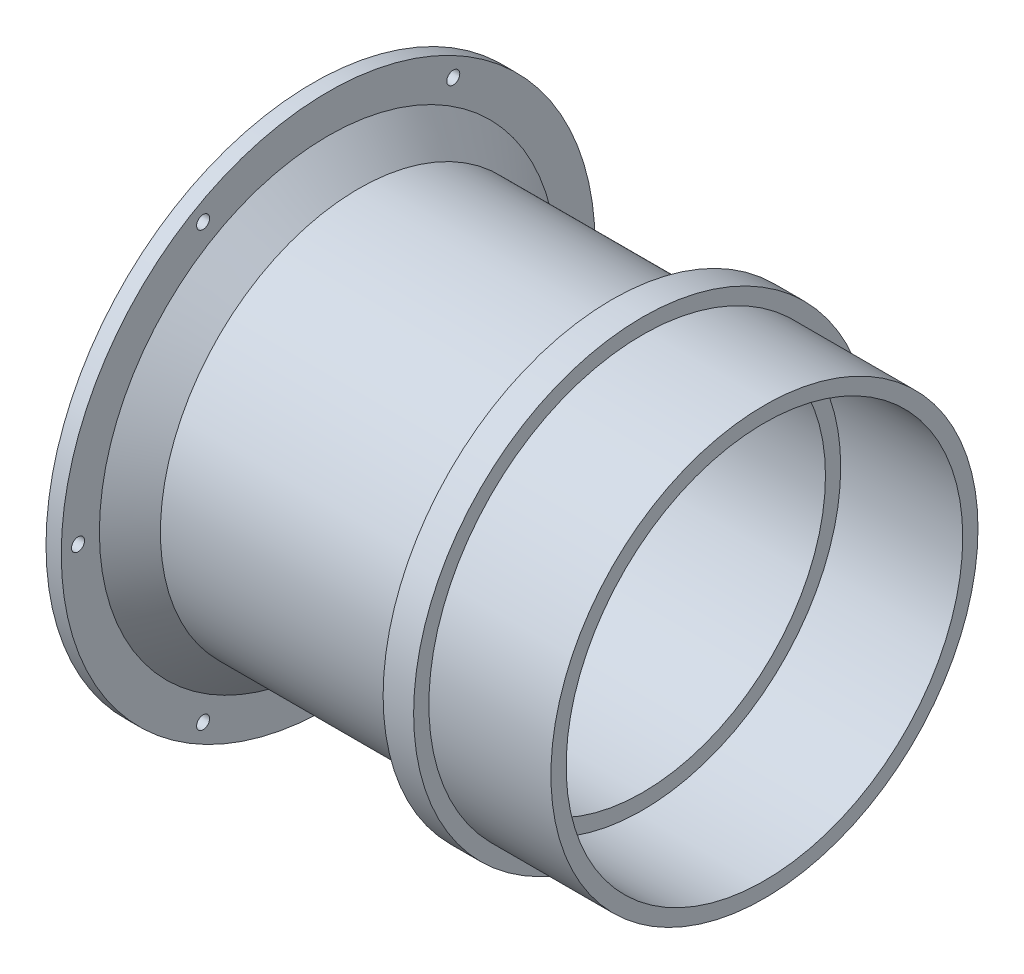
ISO-10303-21;
HEADER;
FILE_DESCRIPTION(('STEP AP214'),'2;1');
FILE_NAME('part.step','',(''),(''),'','','');
FILE_SCHEMA(('AUTOMOTIVE_DESIGN { 1 0 10303 214 1 1 1 1 }'));
ENDSEC;
DATA;
#1=APPLICATION_CONTEXT('core data for automotive mechanical design processes');
#2=APPLICATION_PROTOCOL_DEFINITION('international standard','automotive_design',2000,#1);
#3=PRODUCT_CONTEXT('',#1,'mechanical');
#4=PRODUCT('Part','Part','',(#3));
#5=PRODUCT_RELATED_PRODUCT_CATEGORY('part','',(#4));
#6=PRODUCT_DEFINITION_FORMATION('','',#4);
#7=PRODUCT_DEFINITION_CONTEXT('part definition',#1,'design');
#8=PRODUCT_DEFINITION('design','',#6,#7);
#9=PRODUCT_DEFINITION_SHAPE('','',#8);
#10=(LENGTH_UNIT() NAMED_UNIT(*) SI_UNIT(.MILLI.,.METRE.));
#11=(NAMED_UNIT(*) PLANE_ANGLE_UNIT() SI_UNIT($,.RADIAN.));
#12=(NAMED_UNIT(*) SI_UNIT($,.STERADIAN.) SOLID_ANGLE_UNIT());
#13=UNCERTAINTY_MEASURE_WITH_UNIT(LENGTH_MEASURE(1.E-05),#10,'distance_accuracy_value','');
#14=(GEOMETRIC_REPRESENTATION_CONTEXT(3) GLOBAL_UNCERTAINTY_ASSIGNED_CONTEXT((#13)) GLOBAL_UNIT_ASSIGNED_CONTEXT((#10,
#11,#12)) REPRESENTATION_CONTEXT('',''));
#15=CARTESIAN_POINT('',(0.,0.,0.));
#16=DIRECTION('',(0.,0.,1.));
#17=DIRECTION('',(1.,0.,0.));
#18=AXIS2_PLACEMENT_3D('',#15,#16,#17);
#19=CARTESIAN_POINT('',(0.,0.,0.));
#20=DIRECTION('',(1.,0.,0.));
#21=DIRECTION('',(0.,0.,-1.));
#22=AXIS2_PLACEMENT_3D('',#19,#20,#21);
#23=CYLINDRICAL_SURFACE('',#22,44.45);
#24=CARTESIAN_POINT('',(6.35,0.,0.));
#25=DIRECTION('',(1.,0.,0.));
#26=DIRECTION('',(0.,0.,-1.));
#27=AXIS2_PLACEMENT_3D('',#24,#25,#26);
#28=CIRCLE('',#27,44.45);
#29=CARTESIAN_POINT('',(6.35,0.,-44.45));
#30=VERTEX_POINT('',#29);
#31=EDGE_CURVE('E114',#30,#30,#28,.T.);
#32=ORIENTED_EDGE('',*,*,#31,.T.);
#33=EDGE_LOOP('',(#32));
#34=FACE_BOUND('',#33,.T.);
#35=CARTESIAN_POINT('',(0.,0.,0.));
#36=DIRECTION('',(1.,0.,0.));
#37=DIRECTION('',(0.,0.,-1.));
#38=AXIS2_PLACEMENT_3D('',#35,#36,#37);
#39=CIRCLE('',#38,44.45);
#40=CARTESIAN_POINT('',(0.,0.,-44.45));
#41=VERTEX_POINT('',#40);
#42=EDGE_CURVE('E44',#41,#41,#39,.T.);
#43=ORIENTED_EDGE('',*,*,#42,.F.);
#44=EDGE_LOOP('',(#43));
#45=FACE_BOUND('',#44,.T.);
#46=ADVANCED_FACE('F33',(#34,#45),#23,.F.);
#47=CARTESIAN_POINT('',(0.,48.26,0.));
#48=DIRECTION('',(-1.,0.,0.));
#49=DIRECTION('',(0.,0.,1.));
#50=AXIS2_PLACEMENT_3D('',#47,#48,#49);
#51=PLANE('',#50);
#52=CARTESIAN_POINT('',(0.,0.,0.));
#53=DIRECTION('',(-1.,0.,0.));
#54=DIRECTION('',(0.,0.,1.));
#55=AXIS2_PLACEMENT_3D('',#52,#53,#54);
#56=CIRCLE('',#55,47.752);
#57=CARTESIAN_POINT('',(0.,0.,47.752));
#58=VERTEX_POINT('',#57);
#59=EDGE_CURVE('E10',#58,#58,#56,.T.);
#60=ORIENTED_EDGE('',*,*,#59,.T.);
#61=EDGE_LOOP('',(#60));
#62=FACE_BOUND('',#61,.T.);
#63=ORIENTED_EDGE('',*,*,#42,.T.);
#64=EDGE_LOOP('',(#63));
#65=FACE_BOUND('',#64,.T.);
#66=ADVANCED_FACE('F262',(#62,#65),#51,.T.);
#67=CARTESIAN_POINT('',(0.,0.,0.));
#68=DIRECTION('',(1.,0.,0.));
#69=DIRECTION('',(0.,0.,-1.));
#70=AXIS2_PLACEMENT_3D('',#67,#68,#69);
#71=CYLINDRICAL_SURFACE('',#70,48.26);
#72=CARTESIAN_POINT('',(0.508000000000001,0.,0.));
#73=DIRECTION('',(-1.,0.,0.));
#74=DIRECTION('',(0.,0.,1.));
#75=AXIS2_PLACEMENT_3D('',#72,#73,#74);
#76=CIRCLE('',#75,48.26);
#77=CARTESIAN_POINT('',(0.508000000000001,0.,48.26));
#78=VERTEX_POINT('',#77);
#79=EDGE_CURVE('E40',#78,#78,#76,.F.);
#80=ORIENTED_EDGE('',*,*,#79,.T.);
#81=EDGE_LOOP('',(#80));
#82=FACE_BOUND('',#81,.T.);
#83=CARTESIAN_POINT('',(4.7752,0.,0.));
#84=DIRECTION('',(1.,0.,0.));
#85=DIRECTION('',(0.,0.,-1.));
#86=AXIS2_PLACEMENT_3D('',#83,#84,#85);
#87=CIRCLE('',#86,48.26);
#88=CARTESIAN_POINT('',(4.7752,0.,-48.26));
#89=VERTEX_POINT('',#88);
#90=EDGE_CURVE('E48',#89,#89,#87,.T.);
#91=ORIENTED_EDGE('',*,*,#90,.F.);
#92=EDGE_LOOP('',(#91));
#93=FACE_BOUND('',#92,.T.);
#94=ADVANCED_FACE('F147',(#82,#93),#71,.T.);
#95=CARTESIAN_POINT('',(4.7752,48.26,0.));
#96=DIRECTION('',(-1.,0.,0.));
#97=DIRECTION('',(0.,0.,1.));
#98=AXIS2_PLACEMENT_3D('',#95,#96,#97);
#99=PLANE('',#98);
#100=CARTESIAN_POINT('',(4.7752,-45.0939427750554,-26.0350000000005));
#101=DIRECTION('',(-1.,0.,0.));
#102=DIRECTION('',(0.,0.,1.));
#103=AXIS2_PLACEMENT_3D('',#100,#101,#102);
#104=CIRCLE('',#103,1.35255);
#105=CARTESIAN_POINT('',(4.7752,-45.0939427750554,-24.6824500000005));
#106=VERTEX_POINT('',#105);
#107=EDGE_CURVE('E137',#106,#106,#104,.T.);
#108=ORIENTED_EDGE('',*,*,#107,.F.);
#109=EDGE_LOOP('',(#108));
#110=FACE_BOUND('',#109,.T.);
#111=CARTESIAN_POINT('',(4.7752,-45.093942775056,26.0349999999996));
#112=DIRECTION('',(-1.,0.,0.));
#113=DIRECTION('',(0.,0.,1.));
#114=AXIS2_PLACEMENT_3D('',#111,#112,#113);
#115=CIRCLE('',#114,1.35255);
#116=CARTESIAN_POINT('',(4.7752,-45.093942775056,27.3875499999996));
#117=VERTEX_POINT('',#116);
#118=EDGE_CURVE('E131',#117,#117,#115,.T.);
#119=ORIENTED_EDGE('',*,*,#118,.F.);
#120=EDGE_LOOP('',(#119));
#121=FACE_BOUND('',#120,.T.);
#122=CARTESIAN_POINT('',(4.7752,0.,52.07));
#123=DIRECTION('',(-1.,0.,0.));
#124=DIRECTION('',(0.,0.,1.));
#125=AXIS2_PLACEMENT_3D('',#122,#123,#124);
#126=CIRCLE('',#125,1.35255);
#127=CARTESIAN_POINT('',(4.7752,0.,53.42255));
#128=VERTEX_POINT('',#127);
#129=EDGE_CURVE('E55',#128,#128,#126,.T.);
#130=ORIENTED_EDGE('',*,*,#129,.F.);
#131=EDGE_LOOP('',(#130));
#132=FACE_BOUND('',#131,.T.);
#133=CARTESIAN_POINT('',(4.7752,45.0939427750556,26.0350000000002));
#134=DIRECTION('',(-1.,0.,0.));
#135=DIRECTION('',(0.,0.,1.));
#136=AXIS2_PLACEMENT_3D('',#133,#134,#135);
#137=CIRCLE('',#136,1.35255);
#138=CARTESIAN_POINT('',(4.7752,45.0939427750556,27.3875500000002));
#139=VERTEX_POINT('',#138);
#140=EDGE_CURVE('E54',#139,#139,#137,.T.);
#141=ORIENTED_EDGE('',*,*,#140,.F.);
#142=EDGE_LOOP('',(#141));
#143=FACE_BOUND('',#142,.T.);
#144=CARTESIAN_POINT('',(4.7752,45.0939427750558,-26.0349999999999));
#145=DIRECTION('',(-1.,0.,0.));
#146=DIRECTION('',(0.,0.,1.));
#147=AXIS2_PLACEMENT_3D('',#144,#145,#146);
#148=CIRCLE('',#147,1.35255);
#149=CARTESIAN_POINT('',(4.7752,45.0939427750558,-24.6824499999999));
#150=VERTEX_POINT('',#149);
#151=EDGE_CURVE('E59',#150,#150,#148,.T.);
#152=ORIENTED_EDGE('',*,*,#151,.F.);
#153=EDGE_LOOP('',(#152));
#154=FACE_BOUND('',#153,.T.);
#155=CARTESIAN_POINT('',(4.7752,0.,-52.07));
#156=DIRECTION('',(-1.,0.,0.));
#157=DIRECTION('',(0.,0.,1.));
#158=AXIS2_PLACEMENT_3D('',#155,#156,#157);
#159=CIRCLE('',#158,1.35255);
#160=CARTESIAN_POINT('',(4.7752,0.,-50.71745));
#161=VERTEX_POINT('',#160);
#162=EDGE_CURVE('E62',#161,#161,#159,.T.);
#163=ORIENTED_EDGE('',*,*,#162,.F.);
#164=EDGE_LOOP('',(#163));
#165=FACE_BOUND('',#164,.T.);
#166=ORIENTED_EDGE('',*,*,#90,.T.);
#167=EDGE_LOOP('',(#166));
#168=FACE_BOUND('',#167,.T.);
#169=CARTESIAN_POINT('',(4.7752,0.,0.));
#170=DIRECTION('',(1.,0.,0.));
#171=DIRECTION('',(0.,0.,-1.));
#172=AXIS2_PLACEMENT_3D('',#169,#170,#171);
#173=CIRCLE('',#172,55.5625);
#174=CARTESIAN_POINT('',(4.7752,0.,-55.5625));
#175=VERTEX_POINT('',#174);
#176=EDGE_CURVE('E66',#175,#175,#173,.T.);
#177=ORIENTED_EDGE('',*,*,#176,.F.);
#178=EDGE_LOOP('',(#177));
#179=FACE_BOUND('',#178,.T.);
#180=ADVANCED_FACE('F143',(#110,#121,#132,#143,#154,#165,#168,#179),#99,.T.);
#181=CARTESIAN_POINT('',(0.,0.,0.));
#182=DIRECTION('',(1.,0.,0.));
#183=DIRECTION('',(0.,0.,-1.));
#184=AXIS2_PLACEMENT_3D('',#181,#182,#183);
#185=CYLINDRICAL_SURFACE('',#184,55.5625);
#186=ORIENTED_EDGE('',*,*,#176,.T.);
#187=EDGE_LOOP('',(#186));
#188=FACE_BOUND('',#187,.T.);
#189=CARTESIAN_POINT('',(7.9502,0.,0.));
#190=DIRECTION('',(1.,0.,0.));
#191=DIRECTION('',(0.,0.,-1.));
#192=AXIS2_PLACEMENT_3D('',#189,#190,#191);
#193=CIRCLE('',#192,55.5625);
#194=CARTESIAN_POINT('',(7.9502,0.,-55.5625));
#195=VERTEX_POINT('',#194);
#196=EDGE_CURVE('E69',#195,#195,#193,.T.);
#197=ORIENTED_EDGE('',*,*,#196,.F.);
#198=EDGE_LOOP('',(#197));
#199=FACE_BOUND('',#198,.T.);
#200=ADVANCED_FACE('F146',(#188,#199),#185,.T.);
#201=CARTESIAN_POINT('',(7.9502,55.5625,0.));
#202=DIRECTION('',(1.,0.,0.));
#203=DIRECTION('',(0.,0.,-1.));
#204=AXIS2_PLACEMENT_3D('',#201,#202,#203);
#205=PLANE('',#204);
#206=CARTESIAN_POINT('',(7.9502,-45.0939427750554,-26.0350000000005));
#207=DIRECTION('',(1.,0.,0.));
#208=DIRECTION('',(0.,0.,-1.));
#209=AXIS2_PLACEMENT_3D('',#206,#207,#208);
#210=CIRCLE('',#209,1.35255);
#211=CARTESIAN_POINT('',(7.9502,-45.0939427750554,-27.3875500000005));
#212=VERTEX_POINT('',#211);
#213=EDGE_CURVE('E134',#212,#212,#210,.T.);
#214=ORIENTED_EDGE('',*,*,#213,.F.);
#215=EDGE_LOOP('',(#214));
#216=FACE_BOUND('',#215,.T.);
#217=CARTESIAN_POINT('',(7.9502,-45.093942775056,26.0349999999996));
#218=DIRECTION('',(1.,0.,0.));
#219=DIRECTION('',(0.,0.,-1.));
#220=AXIS2_PLACEMENT_3D('',#217,#218,#219);
#221=CIRCLE('',#220,1.35255);
#222=CARTESIAN_POINT('',(7.9502,-45.093942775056,24.6824499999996));
#223=VERTEX_POINT('',#222);
#224=EDGE_CURVE('E128',#223,#223,#221,.T.);
#225=ORIENTED_EDGE('',*,*,#224,.F.);
#226=EDGE_LOOP('',(#225));
#227=FACE_BOUND('',#226,.T.);
#228=CARTESIAN_POINT('',(7.9502,0.,52.07));
#229=DIRECTION('',(1.,0.,0.));
#230=DIRECTION('',(0.,0.,-1.));
#231=AXIS2_PLACEMENT_3D('',#228,#229,#230);
#232=CIRCLE('',#231,1.35255);
#233=CARTESIAN_POINT('',(7.9502,0.,50.71745));
#234=VERTEX_POINT('',#233);
#235=EDGE_CURVE('E51',#234,#234,#232,.T.);
#236=ORIENTED_EDGE('',*,*,#235,.F.);
#237=EDGE_LOOP('',(#236));
#238=FACE_BOUND('',#237,.T.);
#239=CARTESIAN_POINT('',(7.9502,45.0939427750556,26.0350000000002));
#240=DIRECTION('',(1.,0.,0.));
#241=DIRECTION('',(0.,0.,-1.));
#242=AXIS2_PLACEMENT_3D('',#239,#240,#241);
#243=CIRCLE('',#242,1.35255);
#244=CARTESIAN_POINT('',(7.9502,45.0939427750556,24.6824500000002));
#245=VERTEX_POINT('',#244);
#246=EDGE_CURVE('E56',#245,#245,#243,.T.);
#247=ORIENTED_EDGE('',*,*,#246,.F.);
#248=EDGE_LOOP('',(#247));
#249=FACE_BOUND('',#248,.T.);
#250=CARTESIAN_POINT('',(7.9502,45.0939427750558,-26.0349999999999));
#251=DIRECTION('',(1.,0.,0.));
#252=DIRECTION('',(0.,0.,-1.));
#253=AXIS2_PLACEMENT_3D('',#250,#251,#252);
#254=CIRCLE('',#253,1.35255);
#255=CARTESIAN_POINT('',(7.9502,45.0939427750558,-27.3875499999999));
#256=VERTEX_POINT('',#255);
#257=EDGE_CURVE('E60',#256,#256,#254,.T.);
#258=ORIENTED_EDGE('',*,*,#257,.F.);
#259=EDGE_LOOP('',(#258));
#260=FACE_BOUND('',#259,.T.);
#261=CARTESIAN_POINT('',(7.9502,0.,-52.07));
#262=DIRECTION('',(1.,0.,0.));
#263=DIRECTION('',(0.,0.,-1.));
#264=AXIS2_PLACEMENT_3D('',#261,#262,#263);
#265=CIRCLE('',#264,1.35255);
#266=CARTESIAN_POINT('',(7.9502,0.,-53.42255));
#267=VERTEX_POINT('',#266);
#268=EDGE_CURVE('E117',#267,#267,#265,.T.);
#269=ORIENTED_EDGE('',*,*,#268,.F.);
#270=EDGE_LOOP('',(#269));
#271=FACE_BOUND('',#270,.T.);
#272=ORIENTED_EDGE('',*,*,#196,.T.);
#273=EDGE_LOOP('',(#272));
#274=FACE_BOUND('',#273,.T.);
#275=CARTESIAN_POINT('',(7.9502,0.,0.));
#276=DIRECTION('',(1.,0.,0.));
#277=DIRECTION('',(0.,0.,-1.));
#278=AXIS2_PLACEMENT_3D('',#275,#276,#277);
#279=CIRCLE('',#278,47.625);
#280=CARTESIAN_POINT('',(7.9502,0.,-47.625));
#281=VERTEX_POINT('',#280);
#282=EDGE_CURVE('E72',#281,#281,#279,.T.);
#283=ORIENTED_EDGE('',*,*,#282,.F.);
#284=EDGE_LOOP('',(#283));
#285=FACE_BOUND('',#284,.T.);
#286=ADVANCED_FACE('F165',(#216,#227,#238,#249,#260,#271,#274,#285),#205,.T.);
#287=CARTESIAN_POINT('',(14.3002,0.,0.));
#288=DIRECTION('',(-1.,0.,0.));
#289=DIRECTION('',(0.,0.,1.));
#290=AXIS2_PLACEMENT_3D('',#287,#288,#289);
#291=CONICAL_SURFACE('',#290,41.275,0.78539816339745);
#292=ORIENTED_EDGE('',*,*,#282,.T.);
#293=EDGE_LOOP('',(#292));
#294=FACE_BOUND('',#293,.T.);
#295=CARTESIAN_POINT('',(14.3002,0.,0.));
#296=DIRECTION('',(1.,0.,0.));
#297=DIRECTION('',(0.,0.,-1.));
#298=AXIS2_PLACEMENT_3D('',#295,#296,#297);
#299=CIRCLE('',#298,41.275);
#300=CARTESIAN_POINT('',(14.3002,0.,-41.275));
#301=VERTEX_POINT('',#300);
#302=EDGE_CURVE('E75',#301,#301,#299,.T.);
#303=ORIENTED_EDGE('',*,*,#302,.F.);
#304=EDGE_LOOP('',(#303));
#305=FACE_BOUND('',#304,.T.);
#306=ADVANCED_FACE('F171',(#294,#305),#291,.T.);
#307=CARTESIAN_POINT('',(0.,0.,0.));
#308=DIRECTION('',(1.,0.,0.));
#309=DIRECTION('',(0.,0.,-1.));
#310=AXIS2_PLACEMENT_3D('',#307,#308,#309);
#311=CYLINDRICAL_SURFACE('',#310,41.275);
#312=ORIENTED_EDGE('',*,*,#302,.T.);
#313=EDGE_LOOP('',(#312));
#314=FACE_BOUND('',#313,.T.);
#315=CARTESIAN_POINT('',(65.4177,0.,0.));
#316=DIRECTION('',(1.,0.,0.));
#317=DIRECTION('',(0.,0.,-1.));
#318=AXIS2_PLACEMENT_3D('',#315,#316,#317);
#319=CIRCLE('',#318,41.275);
#320=CARTESIAN_POINT('',(65.4177,0.,-41.275));
#321=VERTEX_POINT('',#320);
#322=EDGE_CURVE('E78',#321,#321,#319,.T.);
#323=ORIENTED_EDGE('',*,*,#322,.F.);
#324=EDGE_LOOP('',(#323));
#325=FACE_BOUND('',#324,.T.);
#326=ADVANCED_FACE('F178',(#314,#325),#311,.T.);
#327=CARTESIAN_POINT('',(67.0052,0.,0.));
#328=DIRECTION('',(1.,0.,0.));
#329=DIRECTION('',(0.,0.,-1.));
#330=AXIS2_PLACEMENT_3D('',#327,#328,#329);
#331=CONICAL_SURFACE('',#330,42.8625,0.785398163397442);
#332=ORIENTED_EDGE('',*,*,#322,.T.);
#333=EDGE_LOOP('',(#332));
#334=FACE_BOUND('',#333,.T.);
#335=CARTESIAN_POINT('',(67.0052,0.,0.));
#336=DIRECTION('',(1.,0.,0.));
#337=DIRECTION('',(0.,0.,-1.));
#338=AXIS2_PLACEMENT_3D('',#335,#336,#337);
#339=CIRCLE('',#338,42.8625);
#340=CARTESIAN_POINT('',(67.0052,0.,-42.8625));
#341=VERTEX_POINT('',#340);
#342=EDGE_CURVE('E81',#341,#341,#339,.T.);
#343=ORIENTED_EDGE('',*,*,#342,.F.);
#344=EDGE_LOOP('',(#343));
#345=FACE_BOUND('',#344,.T.);
#346=ADVANCED_FACE('F184',(#334,#345),#331,.T.);
#347=CARTESIAN_POINT('',(67.0052,42.8625,0.));
#348=DIRECTION('',(-1.,0.,0.));
#349=DIRECTION('',(0.,0.,1.));
#350=AXIS2_PLACEMENT_3D('',#347,#348,#349);
#351=PLANE('',#350);
#352=ORIENTED_EDGE('',*,*,#342,.T.);
#353=EDGE_LOOP('',(#352));
#354=FACE_BOUND('',#353,.T.);
#355=CARTESIAN_POINT('',(67.0052,0.,0.));
#356=DIRECTION('',(1.,0.,0.));
#357=DIRECTION('',(0.,0.,-1.));
#358=AXIS2_PLACEMENT_3D('',#355,#356,#357);
#359=CIRCLE('',#358,47.625);
#360=CARTESIAN_POINT('',(67.0052,0.,-47.625));
#361=VERTEX_POINT('',#360);
#362=EDGE_CURVE('E84',#361,#361,#359,.T.);
#363=ORIENTED_EDGE('',*,*,#362,.F.);
#364=EDGE_LOOP('',(#363));
#365=FACE_BOUND('',#364,.T.);
#366=ADVANCED_FACE('F190',(#354,#365),#351,.T.);
#367=CARTESIAN_POINT('',(0.,0.,0.));
#368=DIRECTION('',(1.,0.,0.));
#369=DIRECTION('',(0.,0.,-1.));
#370=AXIS2_PLACEMENT_3D('',#367,#368,#369);
#371=CYLINDRICAL_SURFACE('',#370,47.625);
#372=ORIENTED_EDGE('',*,*,#362,.T.);
#373=EDGE_LOOP('',(#372));
#374=FACE_BOUND('',#373,.T.);
#375=CARTESIAN_POINT('',(73.3552,0.,0.));
#376=DIRECTION('',(1.,0.,0.));
#377=DIRECTION('',(0.,0.,-1.));
#378=AXIS2_PLACEMENT_3D('',#375,#376,#377);
#379=CIRCLE('',#378,47.625);
#380=CARTESIAN_POINT('',(73.3552,0.,-47.625));
#381=VERTEX_POINT('',#380);
#382=EDGE_CURVE('E87',#381,#381,#379,.T.);
#383=ORIENTED_EDGE('',*,*,#382,.F.);
#384=EDGE_LOOP('',(#383));
#385=FACE_BOUND('',#384,.T.);
#386=ADVANCED_FACE('F196',(#374,#385),#371,.T.);
#387=CARTESIAN_POINT('',(73.3552,44.45,0.));
#388=DIRECTION('',(1.,0.,0.));
#389=DIRECTION('',(0.,0.,-1.));
#390=AXIS2_PLACEMENT_3D('',#387,#388,#389);
#391=PLANE('',#390);
#392=ORIENTED_EDGE('',*,*,#382,.T.);
#393=EDGE_LOOP('',(#392));
#394=FACE_BOUND('',#393,.T.);
#395=CARTESIAN_POINT('',(73.3552,0.,0.));
#396=DIRECTION('',(1.,0.,0.));
#397=DIRECTION('',(0.,0.,-1.));
#398=AXIS2_PLACEMENT_3D('',#395,#396,#397);
#399=CIRCLE('',#398,44.45);
#400=CARTESIAN_POINT('',(73.3552,0.,-44.45));
#401=VERTEX_POINT('',#400);
#402=EDGE_CURVE('E90',#401,#401,#399,.T.);
#403=ORIENTED_EDGE('',*,*,#402,.F.);
#404=EDGE_LOOP('',(#403));
#405=FACE_BOUND('',#404,.T.);
#406=ADVANCED_FACE('F202',(#394,#405),#391,.T.);
#407=CARTESIAN_POINT('',(0.,0.,0.));
#408=DIRECTION('',(1.,0.,0.));
#409=DIRECTION('',(0.,0.,-1.));
#410=AXIS2_PLACEMENT_3D('',#407,#408,#409);
#411=CYLINDRICAL_SURFACE('',#410,44.45);
#412=ORIENTED_EDGE('',*,*,#402,.T.);
#413=EDGE_LOOP('',(#412));
#414=FACE_BOUND('',#413,.T.);
#415=CARTESIAN_POINT('',(98.7552,0.,0.));
#416=DIRECTION('',(1.,0.,0.));
#417=DIRECTION('',(0.,0.,-1.));
#418=AXIS2_PLACEMENT_3D('',#415,#416,#417);
#419=CIRCLE('',#418,44.45);
#420=CARTESIAN_POINT('',(98.7552,0.,-44.45));
#421=VERTEX_POINT('',#420);
#422=EDGE_CURVE('E93',#421,#421,#419,.T.);
#423=ORIENTED_EDGE('',*,*,#422,.F.);
#424=EDGE_LOOP('',(#423));
#425=FACE_BOUND('',#424,.T.);
#426=ADVANCED_FACE('F208',(#414,#425),#411,.T.);
#427=CARTESIAN_POINT('',(98.7552,44.45,0.));
#428=DIRECTION('',(1.,0.,0.));
#429=DIRECTION('',(0.,0.,-1.));
#430=AXIS2_PLACEMENT_3D('',#427,#428,#429);
#431=PLANE('',#430);
#432=ORIENTED_EDGE('',*,*,#422,.T.);
#433=EDGE_LOOP('',(#432));
#434=FACE_BOUND('',#433,.T.);
#435=CARTESIAN_POINT('',(98.7552,0.,0.));
#436=DIRECTION('',(1.,0.,0.));
#437=DIRECTION('',(0.,0.,-1.));
#438=AXIS2_PLACEMENT_3D('',#435,#436,#437);
#439=CIRCLE('',#438,41.275);
#440=CARTESIAN_POINT('',(98.7552,0.,-41.275));
#441=VERTEX_POINT('',#440);
#442=EDGE_CURVE('E96',#441,#441,#439,.T.);
#443=ORIENTED_EDGE('',*,*,#442,.F.);
#444=EDGE_LOOP('',(#443));
#445=FACE_BOUND('',#444,.T.);
#446=ADVANCED_FACE('F214',(#434,#445),#431,.T.);
#447=CARTESIAN_POINT('',(0.,0.,0.));
#448=DIRECTION('',(1.,0.,0.));
#449=DIRECTION('',(0.,0.,-1.));
#450=AXIS2_PLACEMENT_3D('',#447,#448,#449);
#451=CYLINDRICAL_SURFACE('',#450,41.275);
#452=ORIENTED_EDGE('',*,*,#442,.T.);
#453=EDGE_LOOP('',(#452));
#454=FACE_BOUND('',#453,.T.);
#455=CARTESIAN_POINT('',(73.3552,0.,0.));
#456=DIRECTION('',(1.,0.,0.));
#457=DIRECTION('',(0.,0.,-1.));
#458=AXIS2_PLACEMENT_3D('',#455,#456,#457);
#459=CIRCLE('',#458,41.275);
#460=CARTESIAN_POINT('',(73.3552,0.,-41.275));
#461=VERTEX_POINT('',#460);
#462=EDGE_CURVE('E99',#461,#461,#459,.T.);
#463=ORIENTED_EDGE('',*,*,#462,.F.);
#464=EDGE_LOOP('',(#463));
#465=FACE_BOUND('',#464,.T.);
#466=ADVANCED_FACE('F220',(#454,#465),#451,.F.);
#467=CARTESIAN_POINT('',(73.3552,38.1,0.));
#468=DIRECTION('',(1.,0.,0.));
#469=DIRECTION('',(0.,0.,-1.));
#470=AXIS2_PLACEMENT_3D('',#467,#468,#469);
#471=PLANE('',#470);
#472=ORIENTED_EDGE('',*,*,#462,.T.);
#473=EDGE_LOOP('',(#472));
#474=FACE_BOUND('',#473,.T.);
#475=CARTESIAN_POINT('',(73.3552,0.,0.));
#476=DIRECTION('',(1.,0.,0.));
#477=DIRECTION('',(0.,0.,-1.));
#478=AXIS2_PLACEMENT_3D('',#475,#476,#477);
#479=CIRCLE('',#478,38.1);
#480=CARTESIAN_POINT('',(73.3552,0.,-38.1));
#481=VERTEX_POINT('',#480);
#482=EDGE_CURVE('E102',#481,#481,#479,.T.);
#483=ORIENTED_EDGE('',*,*,#482,.F.);
#484=EDGE_LOOP('',(#483));
#485=FACE_BOUND('',#484,.T.);
#486=ADVANCED_FACE('F226',(#474,#485),#471,.T.);
#487=CARTESIAN_POINT('',(0.,0.,0.));
#488=DIRECTION('',(1.,0.,0.));
#489=DIRECTION('',(0.,0.,-1.));
#490=AXIS2_PLACEMENT_3D('',#487,#488,#489);
#491=CYLINDRICAL_SURFACE('',#490,38.1);
#492=ORIENTED_EDGE('',*,*,#482,.T.);
#493=EDGE_LOOP('',(#492));
#494=FACE_BOUND('',#493,.T.);
#495=CARTESIAN_POINT('',(7.1755,0.,0.));
#496=DIRECTION('',(1.,0.,0.));
#497=DIRECTION('',(0.,0.,-1.));
#498=AXIS2_PLACEMENT_3D('',#495,#496,#497);
#499=CIRCLE('',#498,38.1);
#500=CARTESIAN_POINT('',(7.1755,0.,-38.1));
#501=VERTEX_POINT('',#500);
#502=EDGE_CURVE('E105',#501,#501,#499,.T.);
#503=ORIENTED_EDGE('',*,*,#502,.F.);
#504=EDGE_LOOP('',(#503));
#505=FACE_BOUND('',#504,.T.);
#506=ADVANCED_FACE('F232',(#494,#505),#491,.F.);
#507=CARTESIAN_POINT('',(7.1755,42.926,0.));
#508=DIRECTION('',(-1.,0.,0.));
#509=DIRECTION('',(0.,0.,1.));
#510=AXIS2_PLACEMENT_3D('',#507,#508,#509);
#511=PLANE('',#510);
#512=ORIENTED_EDGE('',*,*,#502,.T.);
#513=EDGE_LOOP('',(#512));
#514=FACE_BOUND('',#513,.T.);
#515=CARTESIAN_POINT('',(7.1755,0.,0.));
#516=DIRECTION('',(1.,0.,0.));
#517=DIRECTION('',(0.,0.,-1.));
#518=AXIS2_PLACEMENT_3D('',#515,#516,#517);
#519=CIRCLE('',#518,42.926);
#520=CARTESIAN_POINT('',(7.1755,0.,-42.926));
#521=VERTEX_POINT('',#520);
#522=EDGE_CURVE('E108',#521,#521,#519,.T.);
#523=ORIENTED_EDGE('',*,*,#522,.F.);
#524=EDGE_LOOP('',(#523));
#525=FACE_BOUND('',#524,.T.);
#526=ADVANCED_FACE('F238',(#514,#525),#511,.T.);
#527=CARTESIAN_POINT('',(0.,0.,0.));
#528=DIRECTION('',(1.,0.,0.));
#529=DIRECTION('',(0.,0.,-1.));
#530=AXIS2_PLACEMENT_3D('',#527,#528,#529);
#531=CYLINDRICAL_SURFACE('',#530,42.926);
#532=ORIENTED_EDGE('',*,*,#522,.T.);
#533=EDGE_LOOP('',(#532));
#534=FACE_BOUND('',#533,.T.);
#535=CARTESIAN_POINT('',(6.35,0.,0.));
#536=DIRECTION('',(1.,0.,0.));
#537=DIRECTION('',(0.,0.,-1.));
#538=AXIS2_PLACEMENT_3D('',#535,#536,#537);
#539=CIRCLE('',#538,42.926);
#540=CARTESIAN_POINT('',(6.35,0.,-42.926));
#541=VERTEX_POINT('',#540);
#542=EDGE_CURVE('E111',#541,#541,#539,.T.);
#543=ORIENTED_EDGE('',*,*,#542,.F.);
#544=EDGE_LOOP('',(#543));
#545=FACE_BOUND('',#544,.T.);
#546=ADVANCED_FACE('F244',(#534,#545),#531,.F.);
#547=CARTESIAN_POINT('',(6.35,44.45,0.));
#548=DIRECTION('',(-1.,0.,0.));
#549=DIRECTION('',(0.,0.,1.));
#550=AXIS2_PLACEMENT_3D('',#547,#548,#549);
#551=PLANE('',#550);
#552=ORIENTED_EDGE('',*,*,#542,.T.);
#553=EDGE_LOOP('',(#552));
#554=FACE_BOUND('',#553,.T.);
#555=ORIENTED_EDGE('',*,*,#31,.F.);
#556=EDGE_LOOP('',(#555));
#557=FACE_BOUND('',#556,.T.);
#558=ADVANCED_FACE('F250',(#554,#557),#551,.T.);
#559=CARTESIAN_POINT('',(4.7752,0.,-52.07));
#560=DIRECTION('',(-1.,0.,0.));
#561=DIRECTION('',(0.,0.,1.));
#562=AXIS2_PLACEMENT_3D('',#559,#560,#561);
#563=CYLINDRICAL_SURFACE('',#562,1.35255);
#564=ORIENTED_EDGE('',*,*,#268,.T.);
#565=EDGE_LOOP('',(#564));
#566=FACE_BOUND('',#565,.T.);
#567=ORIENTED_EDGE('',*,*,#162,.T.);
#568=EDGE_LOOP('',(#567));
#569=FACE_BOUND('',#568,.T.);
#570=ADVANCED_FACE('F256',(#566,#569),#563,.F.);
#571=CARTESIAN_POINT('',(4.7752,45.0939427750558,-26.0349999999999));
#572=DIRECTION('',(-1.,0.,0.));
#573=DIRECTION('',(0.,0.,1.));
#574=AXIS2_PLACEMENT_3D('',#571,#572,#573);
#575=CYLINDRICAL_SURFACE('',#574,1.35255);
#576=ORIENTED_EDGE('',*,*,#257,.T.);
#577=EDGE_LOOP('',(#576));
#578=FACE_BOUND('',#577,.T.);
#579=ORIENTED_EDGE('',*,*,#151,.T.);
#580=EDGE_LOOP('',(#579));
#581=FACE_BOUND('',#580,.T.);
#582=ADVANCED_FACE('F275',(#578,#581),#575,.F.);
#583=CARTESIAN_POINT('',(4.7752,45.0939427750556,26.0350000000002));
#584=DIRECTION('',(-1.,0.,0.));
#585=DIRECTION('',(0.,0.,1.));
#586=AXIS2_PLACEMENT_3D('',#583,#584,#585);
#587=CYLINDRICAL_SURFACE('',#586,1.35255);
#588=ORIENTED_EDGE('',*,*,#246,.T.);
#589=EDGE_LOOP('',(#588));
#590=FACE_BOUND('',#589,.T.);
#591=ORIENTED_EDGE('',*,*,#140,.T.);
#592=EDGE_LOOP('',(#591));
#593=FACE_BOUND('',#592,.T.);
#594=ADVANCED_FACE('F279',(#590,#593),#587,.F.);
#595=CARTESIAN_POINT('',(4.7752,0.,52.07));
#596=DIRECTION('',(-1.,0.,0.));
#597=DIRECTION('',(0.,0.,1.));
#598=AXIS2_PLACEMENT_3D('',#595,#596,#597);
#599=CYLINDRICAL_SURFACE('',#598,1.35255);
#600=ORIENTED_EDGE('',*,*,#235,.T.);
#601=EDGE_LOOP('',(#600));
#602=FACE_BOUND('',#601,.T.);
#603=ORIENTED_EDGE('',*,*,#129,.T.);
#604=EDGE_LOOP('',(#603));
#605=FACE_BOUND('',#604,.T.);
#606=ADVANCED_FACE('F283',(#602,#605),#599,.F.);
#607=CARTESIAN_POINT('',(4.7752,-45.093942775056,26.0349999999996));
#608=DIRECTION('',(-1.,0.,0.));
#609=DIRECTION('',(0.,0.,1.));
#610=AXIS2_PLACEMENT_3D('',#607,#608,#609);
#611=CYLINDRICAL_SURFACE('',#610,1.35255);
#612=ORIENTED_EDGE('',*,*,#224,.T.);
#613=EDGE_LOOP('',(#612));
#614=FACE_BOUND('',#613,.T.);
#615=ORIENTED_EDGE('',*,*,#118,.T.);
#616=EDGE_LOOP('',(#615));
#617=FACE_BOUND('',#616,.T.);
#618=ADVANCED_FACE('F287',(#614,#617),#611,.F.);
#619=CARTESIAN_POINT('',(4.7752,-45.0939427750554,-26.0350000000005));
#620=DIRECTION('',(-1.,0.,0.));
#621=DIRECTION('',(0.,0.,1.));
#622=AXIS2_PLACEMENT_3D('',#619,#620,#621);
#623=CYLINDRICAL_SURFACE('',#622,1.35255);
#624=ORIENTED_EDGE('',*,*,#213,.T.);
#625=EDGE_LOOP('',(#624));
#626=FACE_BOUND('',#625,.T.);
#627=ORIENTED_EDGE('',*,*,#107,.T.);
#628=EDGE_LOOP('',(#627));
#629=FACE_BOUND('',#628,.T.);
#630=ADVANCED_FACE('F141',(#626,#629),#623,.F.);
#631=CARTESIAN_POINT('',(0.508000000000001,0.,0.));
#632=DIRECTION('',(-1.,0.,0.));
#633=DIRECTION('',(0.,0.,1.));
#634=AXIS2_PLACEMENT_3D('',#631,#632,#633);
#635=TOROIDAL_SURFACE('',#634,47.752,0.508);
#636=ORIENTED_EDGE('',*,*,#59,.F.);
#637=EDGE_LOOP('',(#636));
#638=FACE_BOUND('',#637,.T.);
#639=ORIENTED_EDGE('',*,*,#79,.F.);
#640=EDGE_LOOP('',(#639));
#641=FACE_BOUND('',#640,.T.);
#642=ADVANCED_FACE('F35',(#638,#641),#635,.T.);
#643=CLOSED_SHELL('',(#46,#66,#94,#180,#200,#286,#306,#326,#346,#366,#386,#406,#426,#446,#466,
#486,#506,#526,#546,#558,#570,#582,#594,#606,#618,#630,#642));
#644=MANIFOLD_SOLID_BREP('B2',#643);
#645=ADVANCED_BREP_SHAPE_REPRESENTATION('',(#18,#644),#14);
#646=SHAPE_DEFINITION_REPRESENTATION(#9,#645);
ENDSEC;
END-ISO-10303-21;
